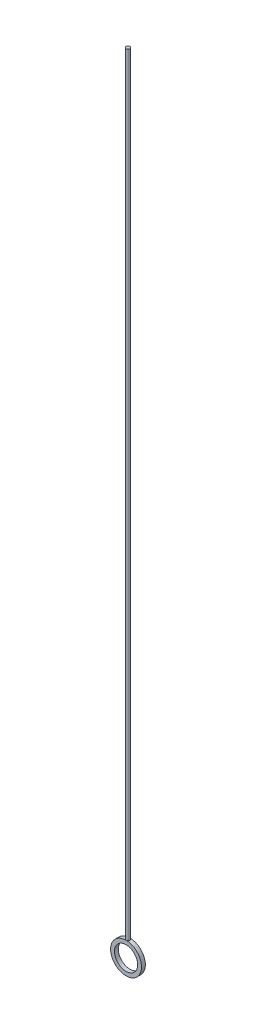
from build123d import *

# Parameters (mm, degrees)
SKETCH1_R           = 4
BOSS_EXTRUDE1_DEPTH = 1
SKETCH2_R           = 3
CUT_EXTRUDE1_DEPTH  = 2
SKETCH3_R           = 0.5
BOSS_EXTRUDE2_DEPTH = 200


with BuildPart() as part:
    # Sketch1 → Boss-Extrude1 (new body)
    with BuildSketch(Plane.XY):
        Circle(SKETCH1_R)
    extrude(amount=BOSS_EXTRUDE1_DEPTH)

    # Sketch2 → Cut-Extrude1 (cut)
    with BuildSketch(Plane.XY.offset(1)):
        Circle(SKETCH2_R)
    extrude(amount=-CUT_EXTRUDE1_DEPTH, mode=Mode.SUBTRACT)


with BuildPart() as body_2:
    # Sketch3 → Boss-Extrude2 (new body)
    with BuildSketch(Plane(origin=(0, 4, 0), x_dir=(1, 0, 0), z_dir=(0, 1, 0))):
        with Locations(Location((0, -0.5, 0), (0, 0, 270))):
            Circle(SKETCH3_R)
    extrude(amount=BOSS_EXTRUDE2_DEPTH)


solid = Compound([part.part, body_2.part])
